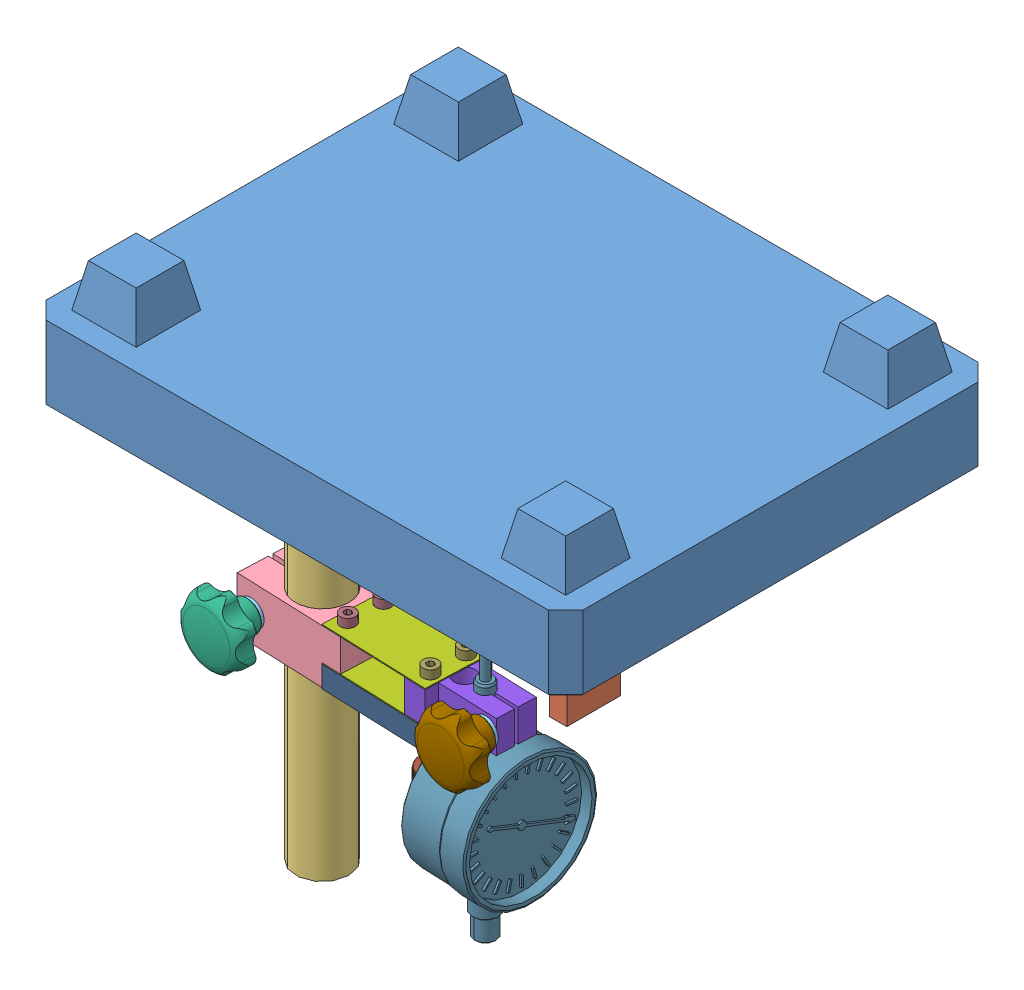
SolidWorks assembly MONTAGE DE CONTROLE U32.SLDASM, configuration Défaut (file format 4400). Lengths in mm.
Overall size (250 245 200).
22 component instances, 15 part files, 9 mates.
Components (placement in the parent):
- marbre-1: marbre.SLDPRT [Défaut] at (-192.8931 -6.4531 -100) size (250 55 200)
- cale étalon-1: cale étalon.SLDPRT [Défaut] at (17.8717 -6.4531 35.2454) x (-1 0 0) z (0 0 1) size (8 47.5 25)
- pied magnetique-1: pied magnetique.SLDPRT [Défaut] at (-107.8931 -6.4531 48.3518) x (0 0 -1) z (-1 0 0) size (40 190 40)
- Support de comparateur à reglage fin-1: Support de comparateur à reglage fin.sldasm [Default] at (-127.8931 -98.9531 28.3518) x (0.999279 0 0.037956) z (0 -1 0) size (137.71 51.6 60.72)
  - 31141-079_halter1_-1: 31141-079_halter1_.sldprt [Default] at origin size (50 30 25)
  - 07300-06-1: 07300-06.sldprt [Default] at (-18 15 0) x (0 1 0) z (-1 0 0) size (1.6 12 12)
  - 06220-4061X25_schwarz-1: 06220-4061X25_schwarz.sldprt [Default] at (-18 16.6 0) x (0 0 -1) z (1 0 0) size (31.35 45 30.71)
  - 31141-079_blech-1: 31141-079_blech.sldprt [Default] at (41 0 2.5) size (50 30 0.5)
  - 31141-079_halter2-1: 31141-079_halter2.sldprt [Default] at (69 0 -5) size (38 30 15)
  - 07300-06-2: 07300-06.sldprt [Default] at (89 9 -5) x (0 1 0) z (-1 0 0) size (1.6 12 12)
  - 06220-4061X15_schwarz-1: 06220-4061X15_schwarz.sldprt [Default] at (89 10.6 -5) x (0 0 -1) z (1 0 0) size (31.35 35 30.71)
  - 31141-079_platte-1: 31141-079_platte.sldprt [Default] at (41 0 3) size (50 30 10)
  - 06092-105X15-1: 06092-105X15.sldprt [Default] at (59 0 18) x (1 0 0) z (0 -1 0) size (21.2 37.05 21.2)
  - M 4_6_schraube-1: M 4_6_schraube.sldprt [Default] at (61 8 3) x (0 0 -1) z (-1 0 0) size (10 7 7)
  - M 4_6_schraube-2: M 4_6_schraube.sldprt [Default] at (61 -8 3) x (0 0 -1) z (-1 0 0) size (10 7 7)
  - 31141-079_blech-2: 31141-079_blech.sldprt [Default] at (41 0 -12.5) x (-1 0 0) z (0 0 -1) size (50 30 0.5)
  - M 4_6_schraube-3: M 4_6_schraube.sldprt [Default] at (61 8 -13) x (0 0 1) z (1 0 0) size (10 7 7)
  - M 4_25_schraube-1: M 4_25_schraube.sldprt [Default] at (21 8 -13) x (0 0 1) z (1 0 0) size (29 7 7)
  - M 4_6_schraube-4: M 4_6_schraube.sldprt [Default] at (61 -8 -13) x (0 0 1) z (1 0 0) size (10 7 7)
  - M 4_25_schraube-2: M 4_25_schraube.sldprt [Default] at (21 -8 -13) x (0 0 1) z (1 0 0) size (29 7 7)
- Comparateur-1: Comparateur.SLDPRT [Défaut] at (-48.95 -132.4531 31.3504) x (0.037956 0 -0.999279) z (-0.999279 0 -0.037956) size (60 132 31.5)
- Nez de broche PH20-1: Nez de broche PH20.SLDPRT [FRAISAGE PH20] at (-39.1324 -6.4531 -36.7888) x (1 0 0) z (0 -1 0) size (45 45 66.5)
Mates (geometry in assembly coordinates):
- Coïncidente6: coincident anti-aligned: plane of marbre-1 through (-192.8931 -6.4531 100) normal (0 -1 0); plane of pied magnetique-1 through (-147.8931 -6.4531 48.3518) normal (0 1 0)
- Distance4: distance = 45 mm aligned: plane of marbre-1 through (-192.8931 -6.4531 100) normal (-1 0 0); plane of pied magnetique-1 through (-147.8931 -46.4531 48.3518) normal (-1 0 0)
- Coaxiale1: concentric aligned: cylinder of pied magnetique-1 through (-127.8931 -196.4531 28.3518) axis (0 1 0) radius 12.5; cylinder of Support de comparateur à reglage fin-1/31141-079_halter1_-1 through (-127.8931 -111.4531 28.3518) axis (0 1 0) radius 12.5
- Coaxiale2: concentric aligned: cylinder of Support de comparateur à reglage fin-1/31141-079_halter2-1 through (-48.95 -102.4531 31.3504) axis (0 1 0) radius 4; cylinder of Comparateur-1 through (-48.95 -132.4531 31.3504) axis (0 1 0) radius 4
- Coïncidente7: coincident anti-aligned: plane of Support de comparateur à reglage fin-1/31141-079_halter2-1 through (-72.5028 -101.4531 45.4666) normal (0 -1 0); plane of Comparateur-1 through (-42.9543 -101.4531 31.5781) normal (0 1 0)
- Parallèle1: parallel anti-aligned: plane of Support de comparateur à reglage fin-1/31141-079_platte-1 through (-61.3713 -111.9531 15.8678) normal (0.999279 0 0.037956); plane of Comparateur-1 through (-58.4432 -132.4531 30.9898) normal (-0.999279 0 -0.037956)
- Coïncidente9: coincident anti-aligned: plane of marbre-1 through (-192.8931 -6.4531 100) normal (0 -1 0); plane of Nez de broche PH20-1 through (-39.1324 -6.4531 -36.7888) normal (0 1 0)
- Coïncidente10: coincident anti-aligned: plane of marbre-1 through (-192.8931 -6.4531 100) normal (0 -1 0); plane of cale étalon-1 through (17.8717 -6.4531 60.2454) normal (0 1 0)
- Coïncidente11: coincident anti-aligned: plane of cale étalon-1 through (17.8717 -53.9531 60.2454) normal (0 -1 0); plane of Comparateur-1 through (-46.9515 -53.9531 31.4263) normal (0 1 0)
